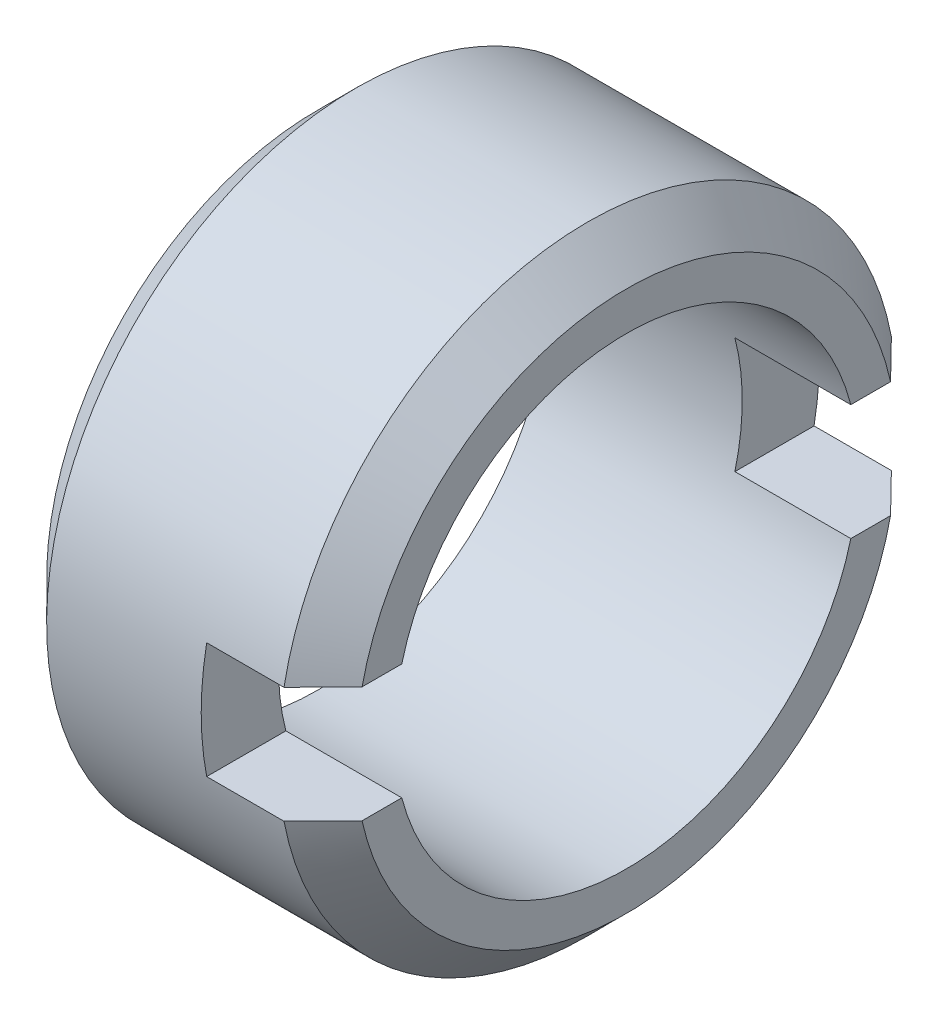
from build123d import *

# Parameters (mm, degrees)
SKETCH_1_R               = 8
SKETCH_1_R_2             = 6
EXTRUDE_1_DEPTH          = 8
CHAMFER_1_SIZE           = 1
CUT_EXTRUDE_1_DEPTH      = 8
CUT_EXTRUDE_1_DEPTH_BACK = 8
SKETCH_2_W               = 3.816883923
SKETCH_2_H               = 3


with BuildPart() as part:
    # Sketch 1 → Extrude 1 (new body)
    with BuildSketch(Plane(origin=(0, 0, 0), x_dir=(0, 0, -1), z_dir=(1, 0, 0))):
        Circle(SKETCH_1_R)
        Circle(SKETCH_1_R_2, mode=Mode.SUBTRACT)
    extrude(amount=EXTRUDE_1_DEPTH)

    # Chamfer 1
    chamfer_1_edges = [part.edges().sort_by_distance(p)[0] for p in [
        (0, 0, 8),
        (8, 0, 8),
    ]]
    chamfer(chamfer_1_edges, length=CHAMFER_1_SIZE)

    # Sketch 2 → Cut-Extrude 1 (cut, two sides: drawn at the far end of the back side and taken through both)
    with BuildSketch(Plane.XY.offset(-CUT_EXTRUDE_1_DEPTH_BACK)):
        with Locations((6.908441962, 0)):
            Rectangle(SKETCH_2_W, SKETCH_2_H)
    extrude(amount=CUT_EXTRUDE_1_DEPTH + CUT_EXTRUDE_1_DEPTH_BACK, mode=Mode.SUBTRACT)


solid = part.part
